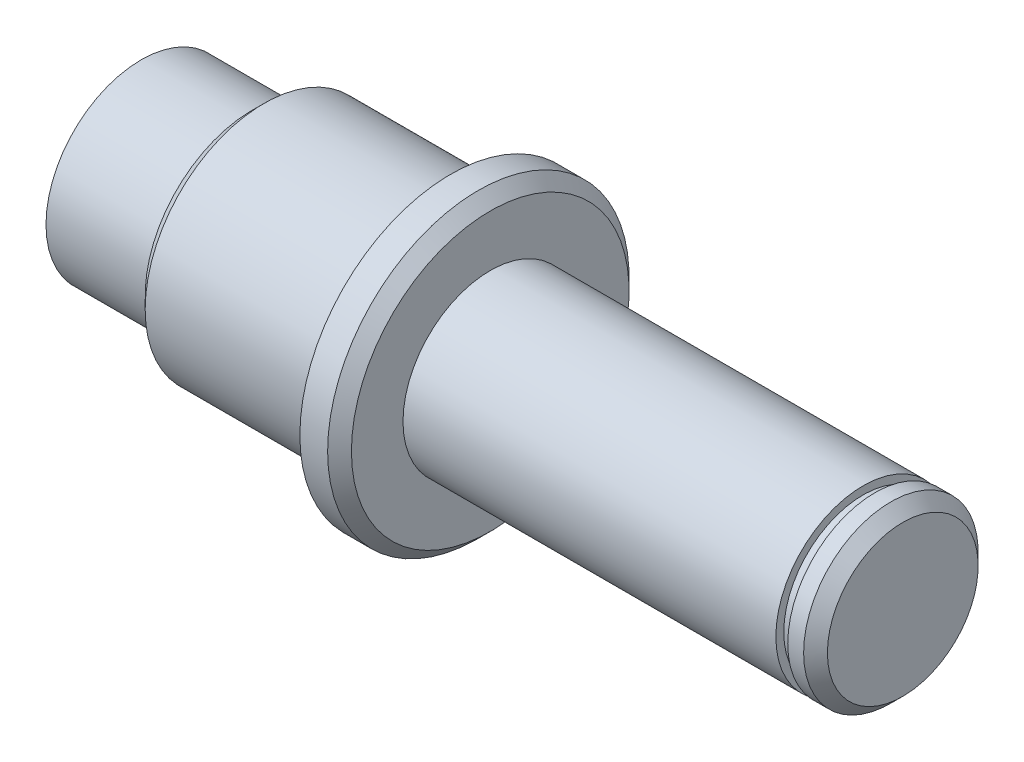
from build123d import *

# Parameters (mm, degrees)
CHANFREIN2_SIZE        = 1.5
RAINURE_DEPTH          = 3
ARRACHEMENT_DEPTH      = 103.581674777
ARRACHEMENT_DEPTH_BACK = 103.581674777
ESQUISSE3_W            = 69
ESQUISSE3_H            = 42


with BuildPart() as part:
    # Esquisse1 → Base-R_volution (revolve)
    with BuildSketch(Plane.XY, mode=Mode.PRIVATE) as base_r_volution_sk:
        with BuildLine():
            Line((17, 15), (42, 15))
            Line((42, 15), (42, 19))
            Line((42, 19), (47, 19))
            Line((47, 19), (47, 11))
            Line((47, 11), (94, 11))
            Line((94, 11), (94, 10))
            Line((94, 10), (95.5, 10))
            Line((95.5, 10), (95.5, 11))
            Line((95.5, 11), (99, 11))
            Line((99, 11), (99, 0))
            Line((99, 0), (-68, 0))
            Line((-68, 0), (-68, 10))
            Line((-68, 10), (-58, 10))
            Line((-58, 10), (-58, 12))
            Line((-58, 12), (-45, 12))
            Line((-45, 12), (-45, 11.5))
            ThreePointArc((-45, 11.5), (-44.560660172, 10.439339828), (-43.5, 10))
            Line((-43.5, 10), (1.5, 10))
            ThreePointArc((1.5, 10), (2.560660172, 10.439339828), (3, 11.5))
            Line((3, 11.5), (3, 12))
            Line((3, 12), (17, 12))
            Line((17, 12), (17, 15))
        make_face()
    revolve(base_r_volution_sk.sketch.rotate(Axis((0, 0, 0), (1, 0, 0)), 90), axis=Axis((0, 0, 0), (1, 0, 0)))

    # Chanfrein2
    chanfrein2_edges = [part.edges().sort_by_distance(p)[0] for p in [
        (17, 0, -15),
        (47, 0, -19),
        (99, 0, -11),
    ]]
    chamfer(chanfrein2_edges, length=CHANFREIN2_SIZE)

    # Esquisse2 → rainure (cut)
    with BuildSketch(Plane(origin=(0, -11, 0), x_dir=(-1, 0, 0), z_dir=(0, 1, 0))):
        with BuildLine():
            Line((-86, 3), (-60, 3))
            ThreePointArc((-60, 3), (-57, 0), (-60, -3))
            Line((-60, -3), (-86, -3))
            ThreePointArc((-86, -3), (-89, 0), (-86, 3))
        make_face()
    extrude(amount=RAINURE_DEPTH, mode=Mode.SUBTRACT)

    # Esquisse3 → arrachement (cut, two sides: drawn at the far end of the back side and taken through both)
    with BuildSketch(Plane.XY.offset(-ARRACHEMENT_DEPTH_BACK)):
        with Locations((-32.5, -1)):
            Rectangle(ESQUISSE3_W, ESQUISSE3_H)
    extrude(amount=ARRACHEMENT_DEPTH + ARRACHEMENT_DEPTH_BACK, mode=Mode.SUBTRACT)


with BuildPart() as arrachement_kept_piece:
    # of the separate pieces the step leaves, the one the design keeps (arrachement_pieces_kept)
    add(part.part.solids().sort_by_distance((17, 0, 13.5))[0])


solid = arrachement_kept_piece.part
